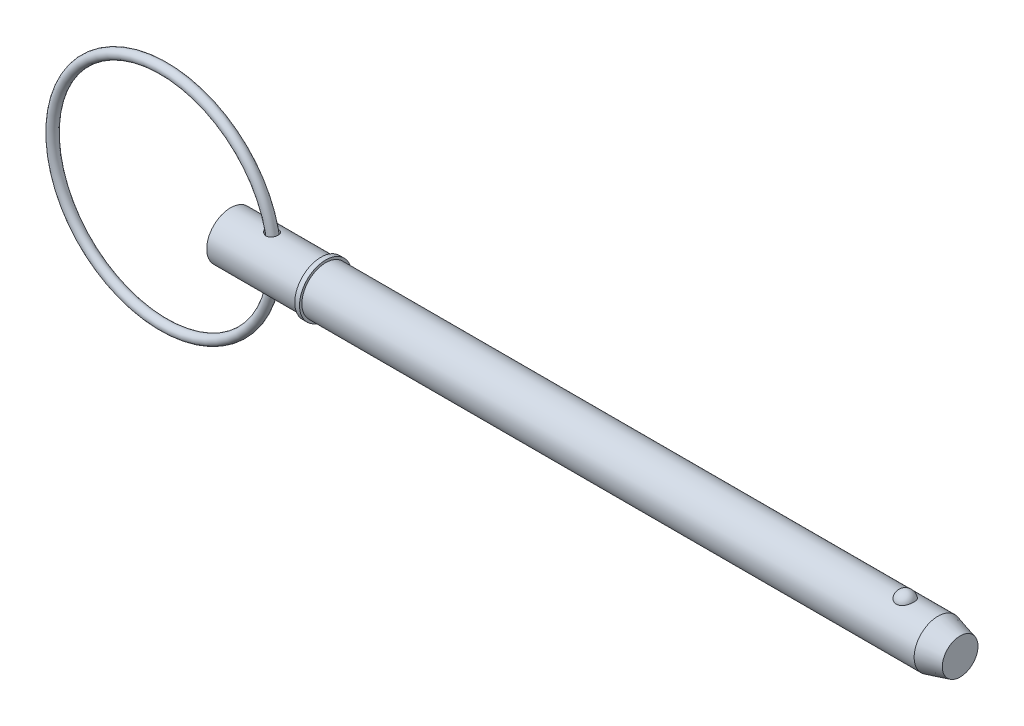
ISO-10303-21;
HEADER;
FILE_DESCRIPTION(('STEP AP214'),'2;1');
FILE_NAME('part.step','',(''),(''),'','','');
FILE_SCHEMA(('AUTOMOTIVE_DESIGN { 1 0 10303 214 1 1 1 1 }'));
ENDSEC;
DATA;
#1=APPLICATION_CONTEXT('core data for automotive mechanical design processes');
#2=APPLICATION_PROTOCOL_DEFINITION('international standard','automotive_design',2000,#1);
#3=PRODUCT_CONTEXT('',#1,'mechanical');
#4=PRODUCT('Part','Part','',(#3));
#5=PRODUCT_RELATED_PRODUCT_CATEGORY('part','',(#4));
#6=PRODUCT_DEFINITION_FORMATION('','',#4);
#7=PRODUCT_DEFINITION_CONTEXT('part definition',#1,'design');
#8=PRODUCT_DEFINITION('design','',#6,#7);
#9=PRODUCT_DEFINITION_SHAPE('','',#8);
#10=(LENGTH_UNIT() NAMED_UNIT(*) SI_UNIT(.MILLI.,.METRE.));
#11=(NAMED_UNIT(*) PLANE_ANGLE_UNIT() SI_UNIT($,.RADIAN.));
#12=(NAMED_UNIT(*) SI_UNIT($,.STERADIAN.) SOLID_ANGLE_UNIT());
#13=UNCERTAINTY_MEASURE_WITH_UNIT(LENGTH_MEASURE(1.E-05),#10,'distance_accuracy_value','');
#14=(GEOMETRIC_REPRESENTATION_CONTEXT(3) GLOBAL_UNCERTAINTY_ASSIGNED_CONTEXT((#13)) GLOBAL_UNIT_ASSIGNED_CONTEXT((#10,
#11,#12)) REPRESENTATION_CONTEXT('',''));
#15=CARTESIAN_POINT('',(0.,0.,0.));
#16=DIRECTION('',(0.,0.,1.));
#17=DIRECTION('',(1.,0.,0.));
#18=AXIS2_PLACEMENT_3D('',#15,#16,#17);
#19=CARTESIAN_POINT('',(-13.4013067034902,0.,0.));
#20=DIRECTION('',(0.,0.,1.));
#21=DIRECTION('',(1.,0.,0.));
#22=AXIS2_PLACEMENT_3D('',#19,#20,#21);
#23=TOROIDAL_SURFACE('',#22,22.225,0.952999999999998);
#24=CARTESIAN_POINT('',(9.77669329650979,0.,0.));
#25=VERTEX_POINT('',#24);
#26=VERTEX_LOOP('',#25);
#27=FACE_BOUND('',#26,.T.);
#28=ADVANCED_FACE('P0_F12',(#27),#23,.T.);
#29=CLOSED_SHELL('',(#28));
#30=MANIFOLD_SOLID_BREP('P0_B1',#29);
#31=CARTESIAN_POINT('',(0.,0.,0.));
#32=DIRECTION('',(1.,0.,0.));
#33=DIRECTION('',(0.,0.,-1.));
#34=AXIS2_PLACEMENT_3D('',#31,#32,#33);
#35=CYLINDRICAL_SURFACE('',#34,4.765);
#36=CARTESIAN_POINT('',(7.31773584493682,4.71580709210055,-0.682926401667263));
#37=CARTESIAN_POINT('',(7.3607471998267,4.70750812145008,-0.740230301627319));
#38=CARTESIAN_POINT('',(7.40883112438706,4.69869300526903,-0.79371122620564));
#39=CARTESIAN_POINT('',(7.51340999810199,4.68106981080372,-0.89180043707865));
#40=CARTESIAN_POINT('',(7.56991882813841,4.67226176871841,-0.936393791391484));
#41=CARTESIAN_POINT('',(7.689548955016,4.65568581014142,-1.01560363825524));
#42=CARTESIAN_POINT('',(7.75265928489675,4.64791621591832,-1.05023633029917));
#43=CARTESIAN_POINT('',(7.88387110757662,4.6343185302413,-1.10870278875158));
#44=CARTESIAN_POINT('',(7.95197058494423,4.62848966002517,-1.13254088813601));
#45=CARTESIAN_POINT('',(8.09209413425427,4.6194749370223,-1.16877415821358));
#46=CARTESIAN_POINT('',(8.16415141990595,4.6163169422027,-1.18104886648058));
#47=CARTESIAN_POINT('',(8.30937958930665,4.61324608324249,-1.19299123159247));
#48=CARTESIAN_POINT('',(8.38255011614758,4.61333220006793,-1.19266284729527));
#49=CARTESIAN_POINT('',(8.52374186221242,4.61674026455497,-1.17939593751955));
#50=CARTESIAN_POINT('',(8.59183022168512,4.61989017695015,-1.16712781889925));
#51=CARTESIAN_POINT('',(8.72470143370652,4.62884731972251,-1.13107903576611));
#52=CARTESIAN_POINT('',(8.78948513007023,4.63465386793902,-1.10730132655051));
#53=CARTESIAN_POINT('',(8.91088768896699,4.64792402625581,-1.05016249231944));
#54=CARTESIAN_POINT('',(8.96774302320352,4.65530108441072,-1.01728198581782));
#55=CARTESIAN_POINT('',(9.07499804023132,4.67102002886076,-0.942471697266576));
#56=CARTESIAN_POINT('',(9.12539777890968,4.6793619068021,-0.900541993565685));
#57=CARTESIAN_POINT('',(9.21836221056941,4.69607497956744,-0.808868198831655));
#58=CARTESIAN_POINT('',(9.26093651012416,4.70444612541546,-0.759133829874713));
#59=CARTESIAN_POINT('',(9.33728390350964,4.72032100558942,-0.653192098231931));
#60=CARTESIAN_POINT('',(9.3710564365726,4.72782468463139,-0.596984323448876));
#61=CARTESIAN_POINT('',(9.42940600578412,4.74126034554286,-0.478808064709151));
#62=CARTESIAN_POINT('',(9.45384681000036,4.74716869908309,-0.416769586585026));
#63=CARTESIAN_POINT('',(9.49226260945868,4.75663465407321,-0.289362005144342));
#64=CARTESIAN_POINT('',(9.50623742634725,4.76019221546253,-0.22399284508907));
#65=CARTESIAN_POINT('',(9.52342004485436,4.76458450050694,-0.0914886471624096));
#66=CARTESIAN_POINT('',(9.52658321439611,4.7654079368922,-0.0243474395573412));
#67=CARTESIAN_POINT('',(9.52194012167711,4.76421136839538,0.109528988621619));
#68=CARTESIAN_POINT('',(9.51413380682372,4.7621913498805,0.176264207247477));
#69=CARTESIAN_POINT('',(9.48775485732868,4.75552896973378,0.307367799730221));
#70=CARTESIAN_POINT('',(9.4691926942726,4.75088915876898,0.371738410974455));
#71=CARTESIAN_POINT('',(9.42175836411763,4.73949008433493,0.496364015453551));
#72=CARTESIAN_POINT('',(9.39288586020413,4.73273075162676,0.556618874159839));
#73=CARTESIAN_POINT('',(9.32549385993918,4.71782154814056,0.671371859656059));
#74=CARTESIAN_POINT('',(9.28696367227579,4.70967013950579,0.725863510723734));
#75=CARTESIAN_POINT('',(9.20123305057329,4.6928883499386,0.827453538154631));
#76=CARTESIAN_POINT('',(9.15403300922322,4.68425799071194,0.874552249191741));
#77=CARTESIAN_POINT('',(9.05250467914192,4.66754854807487,0.959736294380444));
#78=CARTESIAN_POINT('',(8.99822095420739,4.65946646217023,0.997874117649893));
#79=CARTESIAN_POINT('',(8.88381123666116,4.64472049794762,1.06440739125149));
#80=CARTESIAN_POINT('',(8.82368614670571,4.63805640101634,1.09280434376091));
#81=CARTESIAN_POINT('',(8.70022952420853,4.62698068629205,1.13878427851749));
#82=CARTESIAN_POINT('',(8.63695594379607,4.62253830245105,1.15651569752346));
#83=CARTESIAN_POINT('',(8.50825296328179,4.61622454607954,1.18146656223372));
#84=CARTESIAN_POINT('',(8.44282353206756,4.61435321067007,1.18868585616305));
#85=CARTESIAN_POINT('',(8.31119087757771,4.61332122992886,1.19268442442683));
#86=CARTESIAN_POINT('',(8.24498542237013,4.61417920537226,1.18939198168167));
#87=CARTESIAN_POINT('',(8.11397487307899,4.61847671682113,1.17259121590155));
#88=CARTESIAN_POINT('',(8.04917011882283,4.62191687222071,1.15908044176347));
#89=CARTESIAN_POINT('',(7.91946226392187,4.63117528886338,1.12153047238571));
#90=CARTESIAN_POINT('',(7.85470460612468,4.6371000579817,1.09701575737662));
#91=CARTESIAN_POINT('',(7.7300035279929,4.65063246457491,1.03814807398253));
#92=CARTESIAN_POINT('',(7.67006197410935,4.65824075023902,1.00379131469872));
#93=CARTESIAN_POINT('',(7.55352765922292,4.67473656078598,0.924015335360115));
#94=CARTESIAN_POINT('',(7.49726947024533,4.68366994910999,0.878115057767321));
#95=CARTESIAN_POINT('',(7.39344083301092,4.70144936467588,0.777311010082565));
#96=CARTESIAN_POINT('',(7.34587087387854,4.71029538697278,0.722406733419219));
#97=CARTESIAN_POINT('',(7.26188955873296,4.72669773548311,0.605773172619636));
#98=CARTESIAN_POINT('',(7.22531316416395,4.73427229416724,0.544165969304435));
#99=CARTESIAN_POINT('',(7.16406269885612,4.74732663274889,0.415095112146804));
#100=CARTESIAN_POINT('',(7.13937848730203,4.75280819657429,0.347636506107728));
#101=CARTESIAN_POINT('',(7.10494917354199,4.7605495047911,0.215359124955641));
#102=CARTESIAN_POINT('',(7.09405441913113,4.76305589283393,0.150853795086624));
#103=CARTESIAN_POINT('',(7.08387189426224,4.76539656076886,0.0208839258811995));
#104=CARTESIAN_POINT('',(7.0845805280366,4.76523166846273,-0.0445803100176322));
#105=CARTESIAN_POINT('',(7.09709111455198,4.76236014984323,-0.169693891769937));
#106=CARTESIAN_POINT('',(7.10810913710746,4.75983315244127,-0.229428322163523));
#107=CARTESIAN_POINT('',(7.13959099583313,4.75276726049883,-0.346187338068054));
#108=CARTESIAN_POINT('',(7.16004881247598,4.7482296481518,-0.403213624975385));
#109=CARTESIAN_POINT('',(7.20270325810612,4.73907067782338,-0.498040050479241));
#110=CARTESIAN_POINT('',(7.22286864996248,4.73481668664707,-0.536809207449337));
#111=CARTESIAN_POINT('',(7.26730952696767,4.72570777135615,-0.611832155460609));
#112=CARTESIAN_POINT('',(7.29158512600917,4.72085283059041,-0.64808587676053));
#113=CARTESIAN_POINT('',(7.31773584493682,4.71580709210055,-0.682926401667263));
#114=B_SPLINE_CURVE_WITH_KNOTS('',3,(#36,#37,#38,#39,#40,#41,#42,#43,#44,#45,#46,#47,#48,#49,
#50,#51,#52,#53,#54,#55,#56,#57,#58,#59,#60,#61,#62,#63,#64,#65,#66,#67,#68,#69,#70,#71,#72,#73,
#74,#75,#76,#77,#78,#79,#80,#81,#82,#83,#84,#85,#86,#87,#88,#89,#90,#91,#92,#93,#94,#95,#96,#97,
#98,#99,#100,#101,#102,#103,#104,#105,#106,#107,#108,#109,#110,#111,#112,#113),.UNSPECIFIED.,
.T.,.F.,(4,2,2,2,2,2,2,2,2,2,2,2,2,2,2,2,2,2,2,2,2,2,2,2,2,2,2,2,2,2,2,2,2,2,2,2,2,2,4),(0.,
0.216219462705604,0.432799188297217,0.649024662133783,0.865163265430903,1.08352938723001,
1.30182691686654,1.50853487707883,1.71518978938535,1.91252381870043,2.1098561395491,
2.30694457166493,2.50404555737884,2.70392296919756,2.90380378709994,3.10450875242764,
3.30521468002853,3.5057255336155,3.70624293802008,3.90698330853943,4.10771458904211,
4.30723900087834,4.50673262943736,4.70338139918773,4.90003300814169,5.09802914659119,
5.29607279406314,5.5036500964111,5.7113074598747,5.92972727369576,6.14815938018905,
6.36312650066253,6.57790998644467,6.77325899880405,6.96854747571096,7.15009726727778,
7.33153144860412,7.46298830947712,7.59444881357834),.UNSPECIFIED.);
#115=CARTESIAN_POINT('',(7.31773584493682,4.71580709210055,-0.682926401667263));
#116=VERTEX_POINT('',#115);
#117=EDGE_CURVE('P1_E42',#116,#116,#114,.T.);
#118=ORIENTED_EDGE('',*,*,#117,.T.);
#119=EDGE_LOOP('',(#118));
#120=FACE_BOUND('',#119,.T.);
#121=CARTESIAN_POINT('',(0.,0.,0.));
#122=DIRECTION('',(1.,0.,0.));
#123=DIRECTION('',(0.,0.,-1.));
#124=AXIS2_PLACEMENT_3D('',#121,#122,#123);
#125=CIRCLE('',#124,4.765);
#126=CARTESIAN_POINT('',(0.,0.,-4.765));
#127=VERTEX_POINT('',#126);
#128=EDGE_CURVE('P1_E9',#127,#127,#125,.T.);
#129=ORIENTED_EDGE('',*,*,#128,.T.);
#130=EDGE_LOOP('',(#129));
#131=FACE_BOUND('',#130,.T.);
#132=CARTESIAN_POINT('',(18.097,0.,0.));
#133=DIRECTION('',(1.,0.,0.));
#134=DIRECTION('',(0.,0.,-1.));
#135=AXIS2_PLACEMENT_3D('',#132,#133,#134);
#136=CIRCLE('',#135,4.765);
#137=CARTESIAN_POINT('',(18.097,0.,-4.765));
#138=VERTEX_POINT('',#137);
#139=EDGE_CURVE('P1_E25',#138,#138,#136,.T.);
#140=ORIENTED_EDGE('',*,*,#139,.F.);
#141=EDGE_LOOP('',(#140));
#142=FACE_BOUND('',#141,.T.);
#143=CARTESIAN_POINT('',(7.31773584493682,-4.71580709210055,-0.682926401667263));
#144=CARTESIAN_POINT('',(7.27956054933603,-4.72317282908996,-0.63206220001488));
#145=CARTESIAN_POINT('',(7.24535712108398,-4.7301361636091,-0.578155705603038));
#146=CARTESIAN_POINT('',(7.18611785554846,-4.74256090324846,-0.465352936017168));
#147=CARTESIAN_POINT('',(7.16107836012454,-4.74802290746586,-0.406458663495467));
#148=CARTESIAN_POINT('',(7.12119149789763,-4.75686558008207,-0.284913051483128));
#149=CARTESIAN_POINT('',(7.1063796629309,-4.76023898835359,-0.222249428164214));
#150=CARTESIAN_POINT('',(7.08786546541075,-4.76447177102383,-0.0952170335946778));
#151=CARTESIAN_POINT('',(7.08416018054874,-4.76533180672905,-0.0308487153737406));
#152=CARTESIAN_POINT('',(7.08795686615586,-4.76445764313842,0.0942755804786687));
#153=CARTESIAN_POINT('',(7.09490366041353,-4.762851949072,0.155050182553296));
#154=CARTESIAN_POINT('',(7.11863973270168,-4.75746086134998,0.2745356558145));
#155=CARTESIAN_POINT('',(7.13542953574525,-4.75367535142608,0.333246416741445));
#156=CARTESIAN_POINT('',(7.17817193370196,-4.74430545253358,0.447305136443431));
#157=CARTESIAN_POINT('',(7.20415836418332,-4.73871442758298,0.502639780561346));
#158=CARTESIAN_POINT('',(7.26428068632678,-4.72628508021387,0.608523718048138));
#159=CARTESIAN_POINT('',(7.29841897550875,-4.71944639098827,0.659071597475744));
#160=CARTESIAN_POINT('',(7.37680984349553,-4.70456239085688,0.758311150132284));
#161=CARTESIAN_POINT('',(7.42165519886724,-4.69646426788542,0.806526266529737));
#162=CARTESIAN_POINT('',(7.51828933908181,-4.68032890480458,0.895428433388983));
#163=CARTESIAN_POINT('',(7.57008134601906,-4.67229169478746,0.936111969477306));
#164=CARTESIAN_POINT('',(7.68397204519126,-4.65640659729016,1.01229731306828));
#165=CARTESIAN_POINT('',(7.74657226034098,-4.64863251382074,1.04706751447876));
#166=CARTESIAN_POINT('',(7.87680110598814,-4.6349740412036,1.10596507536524));
#167=CARTESIAN_POINT('',(7.94443054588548,-4.62908995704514,1.13009071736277));
#168=CARTESIAN_POINT('',(8.08402017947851,-4.61989019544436,1.16713943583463));
#169=CARTESIAN_POINT('',(8.15603143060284,-4.61661596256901,1.17988211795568));
#170=CARTESIAN_POINT('',(8.30124697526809,-4.61330446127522,1.1927680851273));
#171=CARTESIAN_POINT('',(8.37445077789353,-4.61326589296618,1.19291642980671));
#172=CARTESIAN_POINT('',(8.51584800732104,-4.61644036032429,1.18056687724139));
#173=CARTESIAN_POINT('',(8.58410302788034,-4.61948317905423,1.16873099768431));
#174=CARTESIAN_POINT('',(8.71738052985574,-4.6282520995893,1.13350536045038));
#175=CARTESIAN_POINT('',(8.78240382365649,-4.63397752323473,1.11011852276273));
#176=CARTESIAN_POINT('',(8.90428519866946,-4.64711877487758,1.05371003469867));
#177=CARTESIAN_POINT('',(8.96138096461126,-4.6544450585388,1.02117932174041));
#178=CARTESIAN_POINT('',(9.06916653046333,-4.6700970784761,0.947021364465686));
#179=CARTESIAN_POINT('',(9.11985639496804,-4.67842280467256,0.905394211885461));
#180=CARTESIAN_POINT('',(9.2134071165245,-4.69513303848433,0.814300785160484));
#181=CARTESIAN_POINT('',(9.25628268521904,-4.70351740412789,0.764849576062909));
#182=CARTESIAN_POINT('',(9.33327173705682,-4.71945185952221,0.659422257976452));
#183=CARTESIAN_POINT('',(9.3673846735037,-4.72700189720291,0.603445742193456));
#184=CARTESIAN_POINT('',(9.42645214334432,-4.74055953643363,0.485673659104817));
#185=CARTESIAN_POINT('',(9.45127042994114,-4.74654383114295,0.423807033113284));
#186=CARTESIAN_POINT('',(9.49046298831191,-4.756182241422,0.296676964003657));
#187=CARTESIAN_POINT('',(9.50483706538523,-4.75983631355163,0.231413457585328));
#188=CARTESIAN_POINT('',(9.52283408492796,-4.76443282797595,0.0990368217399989));
#189=CARTESIAN_POINT('',(9.52641016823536,-4.76536345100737,0.0319169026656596));
#190=CARTESIAN_POINT('',(9.52259067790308,-4.76437893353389,-0.101988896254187));
#191=CARTESIAN_POINT('',(9.5151950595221,-4.76246378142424,-0.168774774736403));
#192=CARTESIAN_POINT('',(9.48962516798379,-4.75599746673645,-0.300048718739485));
#193=CARTESIAN_POINT('',(9.4714615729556,-4.75144891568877,-0.364538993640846));
#194=CARTESIAN_POINT('',(9.42480303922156,-4.74020887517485,-0.489470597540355));
#195=CARTESIAN_POINT('',(9.396307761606,-4.73351731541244,-0.549911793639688));
#196=CARTESIAN_POINT('',(9.32963953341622,-4.71871240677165,-0.665099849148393));
#197=CARTESIAN_POINT('',(9.29145577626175,-4.71059747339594,-0.719840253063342));
#198=CARTESIAN_POINT('',(9.20637695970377,-4.69385254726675,-0.82198328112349));
#199=CARTESIAN_POINT('',(9.15948227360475,-4.68522257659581,-0.869386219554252));
#200=CARTESIAN_POINT('',(9.05849937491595,-4.66847516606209,-0.955233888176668));
#201=CARTESIAN_POINT('',(9.00445430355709,-4.6603550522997,-0.993728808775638));
#202=CARTESIAN_POINT('',(8.8904576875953,-4.64550122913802,-1.06100691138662));
#203=CARTESIAN_POINT('',(8.83050704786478,-4.63876730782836,-1.08979157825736));
#204=CARTESIAN_POINT('',(8.70732873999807,-4.6275305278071,-1.13655620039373));
#205=CARTESIAN_POINT('',(8.64416019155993,-4.62299714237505,-1.15468477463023));
#206=CARTESIAN_POINT('',(8.51559711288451,-4.61649071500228,-1.18043067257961));
#207=CARTESIAN_POINT('',(8.4502025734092,-4.61451768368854,-1.18804795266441));
#208=CARTESIAN_POINT('',(8.31862013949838,-4.61328355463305,-1.19283094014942));
#209=CARTESIAN_POINT('',(8.25242983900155,-4.61403911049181,-1.18993246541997));
#210=CARTESIAN_POINT('',(8.12138461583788,-4.61814057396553,-1.17391149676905));
#211=CARTESIAN_POINT('',(8.0565300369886,-4.62148714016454,-1.16078640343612));
#212=CARTESIAN_POINT('',(7.92669960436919,-4.63056912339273,-1.12402333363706));
#213=CARTESIAN_POINT('',(7.86186447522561,-4.63641051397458,-1.09991536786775));
#214=CARTESIAN_POINT('',(7.73694230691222,-4.64980121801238,-1.04185298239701));
#215=CARTESIAN_POINT('',(7.6768568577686,-4.65735110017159,-1.0078952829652));
#216=CARTESIAN_POINT('',(7.56207884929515,-4.67346080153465,-0.930364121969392));
#217=CARTESIAN_POINT('',(7.5074784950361,-4.68203382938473,-0.886656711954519));
#218=CARTESIAN_POINT('',(7.40624045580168,-4.69916824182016,-0.79082583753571));
#219=CARTESIAN_POINT('',(7.35959988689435,-4.7077296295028,-0.738705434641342));
#220=CARTESIAN_POINT('',(7.31773584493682,-4.71580709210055,-0.682926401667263));
#221=B_SPLINE_CURVE_WITH_KNOTS('',3,(#143,#144,#145,#146,#147,#148,#149,#150,#151,#152,#153,
#154,#155,#156,#157,#158,#159,#160,#161,#162,#163,#164,#165,#166,#167,#168,#169,#170,#171,#172,
#173,#174,#175,#176,#177,#178,#179,#180,#181,#182,#183,#184,#185,#186,#187,#188,#189,#190,#191,
#192,#193,#194,#195,#196,#197,#198,#199,#200,#201,#202,#203,#204,#205,#206,#207,#208,#209,#210,
#211,#212,#213,#214,#215,#216,#217,#218,#219,#220),.UNSPECIFIED.,.T.,.F.,(4,2,2,2,2,2,2,2,2,2,2,
2,2,2,2,2,2,2,2,2,2,2,2,2,2,2,2,2,2,2,2,2,2,2,2,2,2,2,4),(0.,0.191851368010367,0.38362606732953,
0.576063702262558,0.768450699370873,0.951145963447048,1.13385097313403,1.31723528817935,
1.50067360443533,1.69887079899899,1.8971602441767,2.11225870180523,2.32739185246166,
2.54587681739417,2.76427400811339,2.97123130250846,3.17813630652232,3.37555441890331,
3.57297054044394,3.77001106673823,3.96706388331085,4.16690159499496,4.36674303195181,
4.56745046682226,4.76815872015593,4.96866827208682,5.16918440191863,5.36992517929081,
5.5706573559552,5.77022940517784,5.96977092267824,6.16645904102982,6.36314797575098,
6.56103940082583,6.75898114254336,6.96633026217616,7.17374850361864,7.384214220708,
7.59460352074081),.UNSPECIFIED.);
#222=CARTESIAN_POINT('',(7.31773584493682,-4.71580709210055,-0.682926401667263));
#223=VERTEX_POINT('',#222);
#224=EDGE_CURVE('P1_E17',#223,#223,#221,.T.);
#225=ORIENTED_EDGE('',*,*,#224,.T.);
#226=EDGE_LOOP('',(#225));
#227=FACE_BOUND('',#226,.T.);
#228=ADVANCED_FACE('P1_F13',(#120,#131,#142,#227),#35,.T.);
#229=CARTESIAN_POINT('',(0.,0.,0.));
#230=DIRECTION('',(1.,0.,0.));
#231=DIRECTION('',(0.,0.,-1.));
#232=AXIS2_PLACEMENT_3D('',#229,#230,#231);
#233=CYLINDRICAL_SURFACE('',#232,4.765);
#234=CARTESIAN_POINT('',(141.604194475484,0.,0.));
#235=DIRECTION('',(1.,0.,0.));
#236=DIRECTION('',(0.,0.,-1.));
#237=AXIS2_PLACEMENT_3D('',#234,#235,#236);
#238=CIRCLE('',#237,4.765);
#239=CARTESIAN_POINT('',(141.604194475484,0.,-4.765));
#240=VERTEX_POINT('',#239);
#241=EDGE_CURVE('P1_E99',#240,#240,#238,.T.);
#242=ORIENTED_EDGE('',*,*,#241,.F.);
#243=EDGE_LOOP('',(#242));
#244=FACE_BOUND('',#243,.T.);
#245=CARTESIAN_POINT('',(19.05,0.,0.));
#246=DIRECTION('',(1.,0.,0.));
#247=DIRECTION('',(0.,0.,-1.));
#248=AXIS2_PLACEMENT_3D('',#245,#246,#247);
#249=CIRCLE('',#248,4.765);
#250=CARTESIAN_POINT('',(19.05,0.,-4.765));
#251=VERTEX_POINT('',#250);
#252=EDGE_CURVE('P1_E96',#251,#251,#249,.T.);
#253=ORIENTED_EDGE('',*,*,#252,.T.);
#254=EDGE_LOOP('',(#253));
#255=FACE_BOUND('',#254,.T.);
#256=CARTESIAN_POINT('',(135.051020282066,4.42764777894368,1.76101111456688));
#257=CARTESIAN_POINT('',(134.959721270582,4.42764470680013,1.76101422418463));
#258=CARTESIAN_POINT('',(134.868446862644,4.43059091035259,1.75366340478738));
#259=CARTESIAN_POINT('',(134.688615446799,4.44201846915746,1.72451180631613));
#260=CARTESIAN_POINT('',(134.600057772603,4.45049845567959,1.70271460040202));
#261=CARTESIAN_POINT('',(134.428257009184,4.47200516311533,1.64539370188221));
#262=CARTESIAN_POINT('',(134.345006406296,4.48502527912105,1.60988994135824));
#263=CARTESIAN_POINT('',(134.185763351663,4.51419542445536,1.52617873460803));
#264=CARTESIAN_POINT('',(134.109772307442,4.53034605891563,1.47796883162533));
#265=CARTESIAN_POINT('',(133.964744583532,4.5645931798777,1.36860494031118));
#266=CARTESIAN_POINT('',(133.895964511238,4.58273170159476,1.30712420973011));
#267=CARTESIAN_POINT('',(133.769342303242,4.61870302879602,1.17370204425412));
#268=CARTESIAN_POINT('',(133.711502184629,4.63653577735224,1.10175868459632));
#269=CARTESIAN_POINT('',(133.605570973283,4.67090140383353,0.945806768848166));
#270=CARTESIAN_POINT('',(133.558030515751,4.68734068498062,0.86140291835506));
#271=CARTESIAN_POINT('',(133.477081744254,4.71628466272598,0.685442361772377));
#272=CARTESIAN_POINT('',(133.443674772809,4.72878898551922,0.593884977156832));
#273=CARTESIAN_POINT('',(133.391287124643,4.74874061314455,0.40478128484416));
#274=CARTESIAN_POINT('',(133.372517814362,4.75611366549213,0.307168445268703));
#275=CARTESIAN_POINT('',(133.350584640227,4.76475393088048,0.109940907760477));
#276=CARTESIAN_POINT('',(133.347420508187,4.76602124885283,0.0103262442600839));
#277=CARTESIAN_POINT('',(133.356740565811,4.76232928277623,-0.187629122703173));
#278=CARTESIAN_POINT('',(133.369158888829,4.7573962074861,-0.285973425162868));
#279=CARTESIAN_POINT('',(133.409280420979,4.74184975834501,-0.479027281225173));
#280=CARTESIAN_POINT('',(133.436983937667,4.7312362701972,-0.573736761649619));
#281=CARTESIAN_POINT('',(133.507158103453,4.70540026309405,-0.756973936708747));
#282=CARTESIAN_POINT('',(133.549646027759,4.69017235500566,-0.845494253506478));
#283=CARTESIAN_POINT('',(133.648520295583,4.65669867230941,-1.01378033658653));
#284=CARTESIAN_POINT('',(133.704907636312,4.63845268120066,-1.09354547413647));
#285=CARTESIAN_POINT('',(133.830552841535,4.60085438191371,-1.24228523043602));
#286=CARTESIAN_POINT('',(133.899843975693,4.58149930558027,-1.31123108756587));
#287=CARTESIAN_POINT('',(134.049606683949,4.54391653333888,-1.43607409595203));
#288=CARTESIAN_POINT('',(134.130077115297,4.52568872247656,-1.49197257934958));
#289=CARTESIAN_POINT('',(134.298150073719,4.49293007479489,-1.58786764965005));
#290=CARTESIAN_POINT('',(134.385544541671,4.47832346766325,-1.62820219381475));
#291=CARTESIAN_POINT('',(134.566553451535,4.45406011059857,-1.69345757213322));
#292=CARTESIAN_POINT('',(134.66016555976,4.44440151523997,-1.71838415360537));
#293=CARTESIAN_POINT('',(134.845893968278,4.43159888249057,-1.75112843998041));
#294=CARTESIAN_POINT('',(134.937849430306,4.42815213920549,-1.75974223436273));
#295=CARTESIAN_POINT('',(135.121965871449,4.427247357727,-1.76201865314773));
#296=CARTESIAN_POINT('',(135.214126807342,4.42978816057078,-1.7556841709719));
#297=CARTESIAN_POINT('',(135.393129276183,4.44038648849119,-1.72869560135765));
#298=CARTESIAN_POINT('',(135.480047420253,4.44827555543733,-1.70847853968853));
#299=CARTESIAN_POINT('',(135.649131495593,4.46852246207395,-1.65479562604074));
#300=CARTESIAN_POINT('',(135.731297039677,4.48088066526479,-1.62132869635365));
#301=CARTESIAN_POINT('',(135.890591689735,4.50907357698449,-1.54120560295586));
#302=CARTESIAN_POINT('',(135.967570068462,4.52497884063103,-1.49427526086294));
#303=CARTESIAN_POINT('',(136.112708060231,4.55845148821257,-1.38881222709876));
#304=CARTESIAN_POINT('',(136.180865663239,4.57601924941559,-1.33027689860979));
#305=CARTESIAN_POINT('',(136.310099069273,4.61196537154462,-1.19991049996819));
#306=CARTESIAN_POINT('',(136.370656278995,4.63034074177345,-1.12756415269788));
#307=CARTESIAN_POINT('',(136.479279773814,4.66513959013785,-0.97361299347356));
#308=CARTESIAN_POINT('',(136.527343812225,4.68156271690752,-0.892006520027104));
#309=CARTESIAN_POINT('',(136.611383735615,4.71130224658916,-0.718892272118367));
#310=CARTESIAN_POINT('',(136.646918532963,4.724501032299,-0.627149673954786));
#311=CARTESIAN_POINT('',(136.702952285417,4.74571823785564,-0.438611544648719));
#312=CARTESIAN_POINT('',(136.723450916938,4.75373654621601,-0.341815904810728));
#313=CARTESIAN_POINT('',(136.749033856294,4.76378905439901,-0.145633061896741));
#314=CARTESIAN_POINT('',(136.754076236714,4.76580697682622,-0.0462395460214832));
#315=CARTESIAN_POINT('',(136.748523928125,4.7636057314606,0.152038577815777));
#316=CARTESIAN_POINT('',(136.737929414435,4.75938663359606,0.250923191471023));
#317=CARTESIAN_POINT('',(136.701387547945,4.74516937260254,0.445004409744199));
#318=CARTESIAN_POINT('',(136.675496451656,4.73519238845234,0.540213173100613));
#319=CARTESIAN_POINT('',(136.608927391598,4.71049394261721,0.72466221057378));
#320=CARTESIAN_POINT('',(136.568248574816,4.69577220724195,0.813902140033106));
#321=CARTESIAN_POINT('',(136.472717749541,4.66303767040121,0.984313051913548));
#322=CARTESIAN_POINT('',(136.417804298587,4.64501070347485,1.06544688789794));
#323=CARTESIAN_POINT('',(136.295049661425,4.60764678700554,1.21692673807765));
#324=CARTESIAN_POINT('',(136.227208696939,4.58830985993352,1.28727293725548));
#325=CARTESIAN_POINT('',(136.080548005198,4.55060370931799,1.41479271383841));
#326=CARTESIAN_POINT('',(136.001791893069,4.53222967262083,1.47203785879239));
#327=CARTESIAN_POINT('',(135.834989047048,4.49849576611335,1.57212016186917));
#328=CARTESIAN_POINT('',(135.746941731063,4.48313608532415,1.6149564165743));
#329=CARTESIAN_POINT('',(135.559791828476,4.45676184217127,1.68642657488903));
#330=CARTESIAN_POINT('',(135.460365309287,4.44598302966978,1.71430590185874));
#331=CARTESIAN_POINT('',(135.257621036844,4.43142918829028,1.75159258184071));
#332=CARTESIAN_POINT('',(135.154304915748,4.42765125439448,1.76100759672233));
#333=CARTESIAN_POINT('',(135.051020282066,4.42764777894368,1.76101111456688));
#334=B_SPLINE_CURVE_WITH_KNOTS('',3,(#256,#257,#258,#259,#260,#261,#262,#263,#264,#265,#266,
#267,#268,#269,#270,#271,#272,#273,#274,#275,#276,#277,#278,#279,#280,#281,#282,#283,#284,#285,
#286,#287,#288,#289,#290,#291,#292,#293,#294,#295,#296,#297,#298,#299,#300,#301,#302,#303,#304,
#305,#306,#307,#308,#309,#310,#311,#312,#313,#314,#315,#316,#317,#318,#319,#320,#321,#322,#323,
#324,#325,#326,#327,#328,#329,#330,#331,#332,#333),.UNSPECIFIED.,.T.,.F.,(4,2,2,2,2,2,2,2,2,2,2,
2,2,2,2,2,2,2,2,2,2,2,2,2,2,2,2,2,2,2,2,2,2,2,2,2,2,2,4),(0.,0.273517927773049,
0.546968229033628,0.820022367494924,1.09312934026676,1.37393946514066,1.6548013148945,
1.94820420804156,2.24163496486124,2.53922817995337,2.83681628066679,3.13315071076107,
3.42949110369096,3.72617893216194,4.02288805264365,4.32037303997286,4.61782764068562,
4.90840095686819,5.19886582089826,5.47474855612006,5.75057789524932,6.0180997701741,
6.28564340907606,6.55907787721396,6.83257454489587,7.11962987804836,7.40673679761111,
7.70312663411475,7.9995228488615,8.29672237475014,8.59391856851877,8.89002850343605,
9.18615552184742,9.48358266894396,9.78100471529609,10.0767610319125,10.3725358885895,
10.6820893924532,10.991514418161),.UNSPECIFIED.);
#335=CARTESIAN_POINT('',(135.051020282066,4.42764777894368,1.76101111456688));
#336=VERTEX_POINT('',#335);
#337=EDGE_CURVE('P1_E34',#336,#336,#334,.T.);
#338=ORIENTED_EDGE('',*,*,#337,.T.);
#339=EDGE_LOOP('',(#338));
#340=FACE_BOUND('',#339,.T.);
#341=ADVANCED_FACE('P1_F46',(#244,#255,#340),#233,.T.);
#342=CARTESIAN_POINT('',(0.,0.,0.));
#343=DIRECTION('',(-1.,0.,0.));
#344=DIRECTION('',(0.,0.,1.));
#345=AXIS2_PLACEMENT_3D('',#342,#343,#344);
#346=PLANE('',#345);
#347=ORIENTED_EDGE('',*,*,#128,.F.);
#348=EDGE_LOOP('',(#347));
#349=FACE_BOUND('',#348,.T.);
#350=ADVANCED_FACE('P1_F15',(#349),#346,.T.);
#351=CARTESIAN_POINT('',(18.097,4.765,0.));
#352=DIRECTION('',(-1.,0.,0.));
#353=DIRECTION('',(0.,0.,1.));
#354=AXIS2_PLACEMENT_3D('',#351,#352,#353);
#355=PLANE('',#354);
#356=ORIENTED_EDGE('',*,*,#139,.T.);
#357=EDGE_LOOP('',(#356));
#358=FACE_BOUND('',#357,.T.);
#359=CARTESIAN_POINT('',(18.097,0.,0.));
#360=DIRECTION('',(1.,0.,0.));
#361=DIRECTION('',(0.,0.,-1.));
#362=AXIS2_PLACEMENT_3D('',#359,#360,#361);
#363=CIRCLE('',#362,5.2415);
#364=CARTESIAN_POINT('',(18.097,0.,-5.2415));
#365=VERTEX_POINT('',#364);
#366=EDGE_CURVE('P1_E30',#365,#365,#363,.T.);
#367=ORIENTED_EDGE('',*,*,#366,.F.);
#368=EDGE_LOOP('',(#367));
#369=FACE_BOUND('',#368,.T.);
#370=ADVANCED_FACE('P1_F81',(#358,#369),#355,.T.);
#371=CARTESIAN_POINT('',(0.,0.,0.));
#372=DIRECTION('',(1.,0.,0.));
#373=DIRECTION('',(0.,0.,-1.));
#374=AXIS2_PLACEMENT_3D('',#371,#372,#373);
#375=CYLINDRICAL_SURFACE('',#374,5.2415);
#376=ORIENTED_EDGE('',*,*,#366,.T.);
#377=EDGE_LOOP('',(#376));
#378=FACE_BOUND('',#377,.T.);
#379=CARTESIAN_POINT('',(19.05,0.,0.));
#380=DIRECTION('',(1.,0.,0.));
#381=DIRECTION('',(0.,0.,-1.));
#382=AXIS2_PLACEMENT_3D('',#379,#380,#381);
#383=CIRCLE('',#382,5.2415);
#384=CARTESIAN_POINT('',(19.05,0.,-5.2415));
#385=VERTEX_POINT('',#384);
#386=EDGE_CURVE('P1_E95',#385,#385,#383,.T.);
#387=ORIENTED_EDGE('',*,*,#386,.F.);
#388=EDGE_LOOP('',(#387));
#389=FACE_BOUND('',#388,.T.);
#390=ADVANCED_FACE('P1_F68',(#378,#389),#375,.T.);
#391=CARTESIAN_POINT('',(19.05,5.2415,0.));
#392=DIRECTION('',(1.,0.,0.));
#393=DIRECTION('',(0.,0.,-1.));
#394=AXIS2_PLACEMENT_3D('',#391,#392,#393);
#395=PLANE('',#394);
#396=ORIENTED_EDGE('',*,*,#386,.T.);
#397=EDGE_LOOP('',(#396));
#398=FACE_BOUND('',#397,.T.);
#399=ORIENTED_EDGE('',*,*,#252,.F.);
#400=EDGE_LOOP('',(#399));
#401=FACE_BOUND('',#400,.T.);
#402=ADVANCED_FACE('P1_F62',(#398,#401),#395,.T.);
#403=CARTESIAN_POINT('',(146.05,0.,0.));
#404=DIRECTION('',(-1.,0.,0.));
#405=DIRECTION('',(0.,0.,1.));
#406=AXIS2_PLACEMENT_3D('',#403,#404,#405);
#407=CONICAL_SURFACE('',#406,3.57375000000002,0.261799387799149);
#408=ORIENTED_EDGE('',*,*,#241,.T.);
#409=EDGE_LOOP('',(#408));
#410=FACE_BOUND('',#409,.T.);
#411=CARTESIAN_POINT('',(146.05,0.,0.));
#412=DIRECTION('',(1.,0.,0.));
#413=DIRECTION('',(0.,0.,-1.));
#414=AXIS2_PLACEMENT_3D('',#411,#412,#413);
#415=CIRCLE('',#414,3.57375000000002);
#416=CARTESIAN_POINT('',(146.05,0.,-3.57375000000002));
#417=VERTEX_POINT('',#416);
#418=EDGE_CURVE('P1_E41',#417,#417,#415,.T.);
#419=ORIENTED_EDGE('',*,*,#418,.F.);
#420=EDGE_LOOP('',(#419));
#421=FACE_BOUND('',#420,.T.);
#422=ADVANCED_FACE('P1_F59',(#410,#421),#407,.T.);
#423=CARTESIAN_POINT('',(146.05,3.57375000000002,0.));
#424=DIRECTION('',(1.,0.,0.));
#425=DIRECTION('',(0.,0.,-1.));
#426=AXIS2_PLACEMENT_3D('',#423,#424,#425);
#427=PLANE('',#426);
#428=ORIENTED_EDGE('',*,*,#418,.T.);
#429=EDGE_LOOP('',(#428));
#430=FACE_BOUND('',#429,.T.);
#431=ADVANCED_FACE('P1_F55',(#430),#427,.T.);
#432=CARTESIAN_POINT('',(135.051020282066,4.2885,0.));
#433=DIRECTION('',(-1.,0.,0.));
#434=DIRECTION('',(0.,-1.,0.));
#435=AXIS2_PLACEMENT_3D('',#432,#433,#434);
#436=SPHERICAL_SURFACE('',#435,1.7665);
#437=ORIENTED_EDGE('',*,*,#337,.F.);
#438=EDGE_LOOP('',(#437));
#439=FACE_BOUND('',#438,.T.);
#440=ADVANCED_FACE('P1_F50',(#439),#436,.T.);
#441=CARTESIAN_POINT('',(-13.4013067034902,0.,0.));
#442=DIRECTION('',(0.,0.,1.));
#443=DIRECTION('',(1.,0.,0.));
#444=AXIS2_PLACEMENT_3D('',#441,#442,#443);
#445=TOROIDAL_SURFACE('',#444,22.225,1.19125);
#446=ORIENTED_EDGE('',*,*,#224,.F.);
#447=EDGE_LOOP('',(#446));
#448=FACE_BOUND('',#447,.T.);
#449=ORIENTED_EDGE('',*,*,#117,.F.);
#450=EDGE_LOOP('',(#449));
#451=FACE_BOUND('',#450,.T.);
#452=ADVANCED_FACE('P1_F54',(#448,#451),#445,.F.);
#453=CLOSED_SHELL('',(#228,#341,#350,#370,#390,#402,#422,#431,#440,#452));
#454=MANIFOLD_SOLID_BREP('P1_B1',#453);
#455=ADVANCED_BREP_SHAPE_REPRESENTATION('',(#18,#30,#454),#14);
#456=SHAPE_DEFINITION_REPRESENTATION(#9,#455);
ENDSEC;
END-ISO-10303-21;
